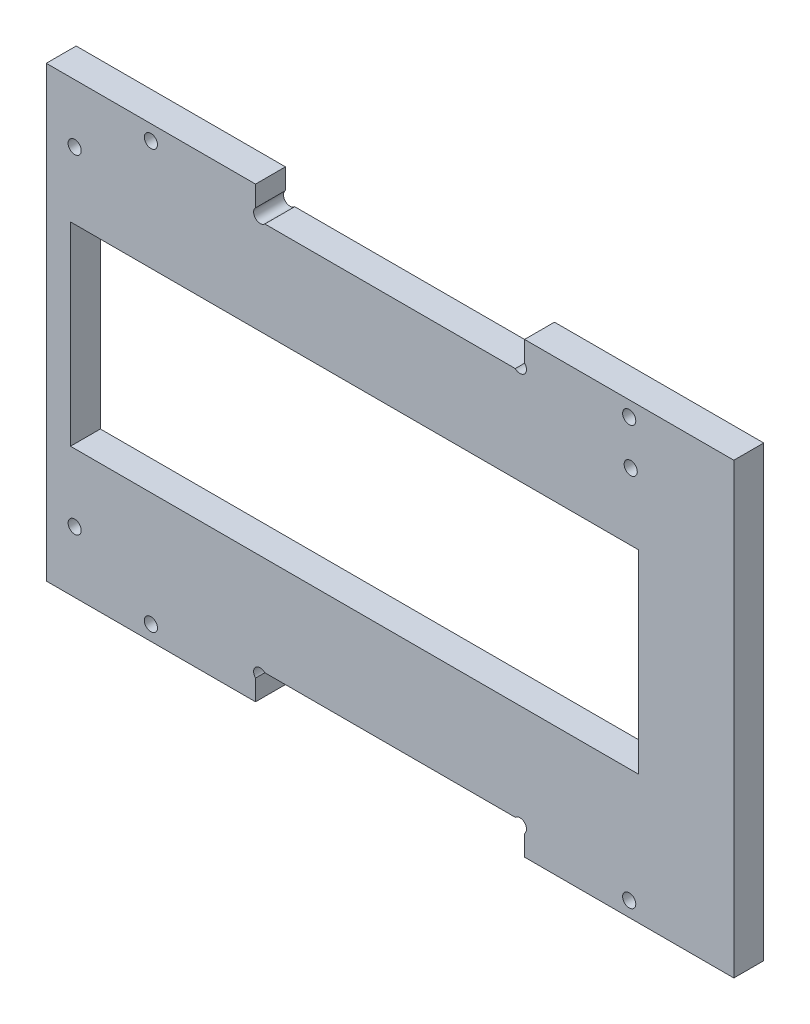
ISO-10303-21;
HEADER;
FILE_DESCRIPTION(('STEP AP214'),'2;1');
FILE_NAME('part.step','',(''),(''),'','','');
FILE_SCHEMA(('AUTOMOTIVE_DESIGN { 1 0 10303 214 1 1 1 1 }'));
ENDSEC;
DATA;
#1=APPLICATION_CONTEXT('core data for automotive mechanical design processes');
#2=APPLICATION_PROTOCOL_DEFINITION('international standard','automotive_design',2000,#1);
#3=PRODUCT_CONTEXT('',#1,'mechanical');
#4=PRODUCT('Part','Part','',(#3));
#5=PRODUCT_RELATED_PRODUCT_CATEGORY('part','',(#4));
#6=PRODUCT_DEFINITION_FORMATION('','',#4);
#7=PRODUCT_DEFINITION_CONTEXT('part definition',#1,'design');
#8=PRODUCT_DEFINITION('design','',#6,#7);
#9=PRODUCT_DEFINITION_SHAPE('','',#8);
#10=(LENGTH_UNIT() NAMED_UNIT(*) SI_UNIT(.MILLI.,.METRE.));
#11=(NAMED_UNIT(*) PLANE_ANGLE_UNIT() SI_UNIT($,.RADIAN.));
#12=(NAMED_UNIT(*) SI_UNIT($,.STERADIAN.) SOLID_ANGLE_UNIT());
#13=UNCERTAINTY_MEASURE_WITH_UNIT(LENGTH_MEASURE(1.E-05),#10,'distance_accuracy_value','');
#14=(GEOMETRIC_REPRESENTATION_CONTEXT(3) GLOBAL_UNCERTAINTY_ASSIGNED_CONTEXT((#13)) GLOBAL_UNIT_ASSIGNED_CONTEXT((#10,
#11,#12)) REPRESENTATION_CONTEXT('',''));
#15=CARTESIAN_POINT('',(0.,0.,0.));
#16=DIRECTION('',(0.,0.,1.));
#17=DIRECTION('',(1.,0.,0.));
#18=AXIS2_PLACEMENT_3D('',#15,#16,#17);
#19=CARTESIAN_POINT('',(0.,75.,5.));
#20=DIRECTION('',(0.,0.,-1.));
#21=DIRECTION('',(-1.,0.,0.));
#22=AXIS2_PLACEMENT_3D('',#19,#20,#21);
#23=PLANE('',#22);
#24=CARTESIAN_POINT('',(17.5,72.5,5.));
#25=DIRECTION('',(0.,0.,-1.));
#26=DIRECTION('',(-1.,0.,0.));
#27=AXIS2_PLACEMENT_3D('',#24,#25,#26);
#28=CIRCLE('',#27,1.10000000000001);
#29=CARTESIAN_POINT('',(16.4,72.5,5.));
#30=VERTEX_POINT('',#29);
#31=EDGE_CURVE('E784',#30,#30,#28,.T.);
#32=ORIENTED_EDGE('',*,*,#31,.T.);
#33=EDGE_LOOP('',(#32));
#34=FACE_BOUND('',#33,.T.);
#35=CARTESIAN_POINT('',(97.5,72.5,5.));
#36=DIRECTION('',(0.,0.,1.));
#37=DIRECTION('',(1.,0.,0.));
#38=AXIS2_PLACEMENT_3D('',#35,#36,#37);
#39=CIRCLE('',#38,1.10000000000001);
#40=CARTESIAN_POINT('',(98.6,72.5,5.));
#41=VERTEX_POINT('',#40);
#42=EDGE_CURVE('E228',#41,#41,#39,.T.);
#43=ORIENTED_EDGE('',*,*,#42,.F.);
#44=EDGE_LOOP('',(#43));
#45=FACE_BOUND('',#44,.T.);
#46=CARTESIAN_POINT('',(4.75,10.25,5.));
#47=DIRECTION('',(0.,0.,1.));
#48=DIRECTION('',(1.,0.,0.));
#49=AXIS2_PLACEMENT_3D('',#46,#47,#48);
#50=CIRCLE('',#49,1.1);
#51=CARTESIAN_POINT('',(5.85,10.25,5.));
#52=VERTEX_POINT('',#51);
#53=EDGE_CURVE('E315',#52,#52,#50,.T.);
#54=ORIENTED_EDGE('',*,*,#53,.F.);
#55=EDGE_LOOP('',(#54));
#56=FACE_BOUND('',#55,.T.);
#57=CARTESIAN_POINT('',(97.75,65.25,5.));
#58=DIRECTION('',(0.,0.,1.));
#59=DIRECTION('',(1.,0.,0.));
#60=AXIS2_PLACEMENT_3D('',#57,#58,#59);
#61=CIRCLE('',#60,1.10000000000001);
#62=CARTESIAN_POINT('',(98.85,65.25,5.));
#63=VERTEX_POINT('',#62);
#64=EDGE_CURVE('E321',#63,#63,#61,.T.);
#65=ORIENTED_EDGE('',*,*,#64,.F.);
#66=EDGE_LOOP('',(#65));
#67=FACE_BOUND('',#66,.T.);
#68=CARTESIAN_POINT('',(4.75,65.25,5.));
#69=DIRECTION('',(0.,0.,1.));
#70=DIRECTION('',(1.,0.,0.));
#71=AXIS2_PLACEMENT_3D('',#68,#69,#70);
#72=CIRCLE('',#71,1.1);
#73=CARTESIAN_POINT('',(5.85,65.25,5.));
#74=VERTEX_POINT('',#73);
#75=EDGE_CURVE('E327',#74,#74,#72,.T.);
#76=ORIENTED_EDGE('',*,*,#75,.F.);
#77=EDGE_LOOP('',(#76));
#78=FACE_BOUND('',#77,.T.);
#79=DIRECTION('',(1.,0.,0.));
#80=VECTOR('',#79,1.);
#81=CARTESIAN_POINT('',(4.05,21.55,5.));
#82=LINE('',#81,#80);
#83=CARTESIAN_POINT('',(4.05,21.55,5.));
#84=VERTEX_POINT('',#83);
#85=CARTESIAN_POINT('',(99.05,21.55,5.));
#86=VERTEX_POINT('',#85);
#87=EDGE_CURVE('E343',#84,#86,#82,.T.);
#88=ORIENTED_EDGE('',*,*,#87,.F.);
#89=DIRECTION('',(0.,-1.,0.));
#90=VECTOR('',#89,1.);
#91=CARTESIAN_POINT('',(4.05,21.55,5.));
#92=LINE('',#91,#90);
#93=CARTESIAN_POINT('',(4.05,54.05,5.));
#94=VERTEX_POINT('',#93);
#95=EDGE_CURVE('E341',#94,#84,#92,.T.);
#96=ORIENTED_EDGE('',*,*,#95,.F.);
#97=DIRECTION('',(-1.,0.,0.));
#98=VECTOR('',#97,1.);
#99=CARTESIAN_POINT('',(4.05,54.05,5.));
#100=LINE('',#99,#98);
#101=CARTESIAN_POINT('',(99.05,54.05,5.));
#102=VERTEX_POINT('',#101);
#103=EDGE_CURVE('E349',#102,#94,#100,.T.);
#104=ORIENTED_EDGE('',*,*,#103,.F.);
#105=DIRECTION('',(0.,1.,0.));
#106=VECTOR('',#105,1.);
#107=CARTESIAN_POINT('',(99.05,21.55,5.));
#108=LINE('',#107,#106);
#109=EDGE_CURVE('E346',#86,#102,#108,.T.);
#110=ORIENTED_EDGE('',*,*,#109,.F.);
#111=EDGE_LOOP('',(#88,#96,#104,#110));
#112=FACE_BOUND('',#111,.T.);
#113=CARTESIAN_POINT('',(79.2221825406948,4.2221825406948,5.));
#114=DIRECTION('',(0.,0.,1.));
#115=DIRECTION('',(1.,0.,0.));
#116=AXIS2_PLACEMENT_3D('',#113,#114,#115);
#117=CIRCLE('',#116,1.10000000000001);
#118=CARTESIAN_POINT('',(80.,3.44436508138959,5.));
#119=VERTEX_POINT('',#118);
#120=CARTESIAN_POINT('',(78.4443650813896,5.,5.));
#121=VERTEX_POINT('',#120);
#122=EDGE_CURVE('E251',#119,#121,#117,.T.);
#123=ORIENTED_EDGE('',*,*,#122,.F.);
#124=DIRECTION('',(0.,1.,0.));
#125=VECTOR('',#124,1.);
#126=CARTESIAN_POINT('',(80.,0.,5.));
#127=LINE('',#126,#125);
#128=CARTESIAN_POINT('',(80.,0.,5.));
#129=VERTEX_POINT('',#128);
#130=EDGE_CURVE('E280',#129,#119,#127,.T.);
#131=ORIENTED_EDGE('',*,*,#130,.F.);
#132=DIRECTION('',(1.,0.,0.));
#133=VECTOR('',#132,1.);
#134=CARTESIAN_POINT('',(0.,0.,5.));
#135=LINE('',#134,#133);
#136=CARTESIAN_POINT('',(115.,0.,5.));
#137=VERTEX_POINT('',#136);
#138=EDGE_CURVE('E368',#129,#137,#135,.T.);
#139=ORIENTED_EDGE('',*,*,#138,.T.);
#140=DIRECTION('',(0.,1.,0.));
#141=VECTOR('',#140,1.);
#142=CARTESIAN_POINT('',(115.,0.,5.));
#143=LINE('',#142,#141);
#144=CARTESIAN_POINT('',(115.,75.,5.));
#145=VERTEX_POINT('',#144);
#146=EDGE_CURVE('E373',#137,#145,#143,.T.);
#147=ORIENTED_EDGE('',*,*,#146,.T.);
#148=DIRECTION('',(-1.,0.,0.));
#149=VECTOR('',#148,1.);
#150=CARTESIAN_POINT('',(0.,75.,5.));
#151=LINE('',#150,#149);
#152=CARTESIAN_POINT('',(80.,75.,5.));
#153=VERTEX_POINT('',#152);
#154=EDGE_CURVE('E376',#145,#153,#151,.T.);
#155=ORIENTED_EDGE('',*,*,#154,.T.);
#156=DIRECTION('',(0.,1.,0.));
#157=VECTOR('',#156,1.);
#158=CARTESIAN_POINT('',(80.,75.,5.));
#159=LINE('',#158,#157);
#160=CARTESIAN_POINT('',(80.,71.5556349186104,5.));
#161=VERTEX_POINT('',#160);
#162=EDGE_CURVE('E304',#161,#153,#159,.T.);
#163=ORIENTED_EDGE('',*,*,#162,.F.);
#164=CARTESIAN_POINT('',(79.2221825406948,70.7778174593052,5.));
#165=DIRECTION('',(0.,0.,1.));
#166=DIRECTION('',(1.,0.,0.));
#167=AXIS2_PLACEMENT_3D('',#164,#165,#166);
#168=CIRCLE('',#167,1.10000000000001);
#169=CARTESIAN_POINT('',(78.4443650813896,70.,5.));
#170=VERTEX_POINT('',#169);
#171=EDGE_CURVE('E264',#170,#161,#168,.T.);
#172=ORIENTED_EDGE('',*,*,#171,.F.);
#173=DIRECTION('',(1.,0.,0.));
#174=VECTOR('',#173,1.);
#175=CARTESIAN_POINT('',(35.,70.,5.));
#176=LINE('',#175,#174);
#177=CARTESIAN_POINT('',(36.5556349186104,70.,5.));
#178=VERTEX_POINT('',#177);
#179=EDGE_CURVE('E301',#178,#170,#176,.T.);
#180=ORIENTED_EDGE('',*,*,#179,.F.);
#181=CARTESIAN_POINT('',(35.7778174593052,70.7778174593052,5.));
#182=DIRECTION('',(0.,0.,1.));
#183=DIRECTION('',(1.,0.,0.));
#184=AXIS2_PLACEMENT_3D('',#181,#182,#183);
#185=CIRCLE('',#184,1.1);
#186=CARTESIAN_POINT('',(35.,71.5556349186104,5.));
#187=VERTEX_POINT('',#186);
#188=EDGE_CURVE('E270',#187,#178,#185,.T.);
#189=ORIENTED_EDGE('',*,*,#188,.F.);
#190=DIRECTION('',(0.,-1.,0.));
#191=VECTOR('',#190,1.);
#192=CARTESIAN_POINT('',(35.,75.,5.));
#193=LINE('',#192,#191);
#194=CARTESIAN_POINT('',(35.,75.,5.));
#195=VERTEX_POINT('',#194);
#196=EDGE_CURVE('E298',#195,#187,#193,.T.);
#197=ORIENTED_EDGE('',*,*,#196,.F.);
#198=CARTESIAN_POINT('',(0.,75.,5.));
#199=VERTEX_POINT('',#198);
#200=EDGE_CURVE('E375',#195,#199,#151,.T.);
#201=ORIENTED_EDGE('',*,*,#200,.T.);
#202=DIRECTION('',(0.,-1.,0.));
#203=VECTOR('',#202,1.);
#204=CARTESIAN_POINT('',(0.,0.,5.));
#205=LINE('',#204,#203);
#206=CARTESIAN_POINT('',(0.,0.,5.));
#207=VERTEX_POINT('',#206);
#208=EDGE_CURVE('E365',#199,#207,#205,.T.);
#209=ORIENTED_EDGE('',*,*,#208,.T.);
#210=CARTESIAN_POINT('',(35.,0.,5.));
#211=VERTEX_POINT('',#210);
#212=EDGE_CURVE('E370',#207,#211,#135,.T.);
#213=ORIENTED_EDGE('',*,*,#212,.T.);
#214=DIRECTION('',(0.,-1.,0.));
#215=VECTOR('',#214,1.);
#216=CARTESIAN_POINT('',(35.,0.,5.));
#217=LINE('',#216,#215);
#218=CARTESIAN_POINT('',(35.,3.44436508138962,5.));
#219=VERTEX_POINT('',#218);
#220=EDGE_CURVE('E285',#219,#211,#217,.T.);
#221=ORIENTED_EDGE('',*,*,#220,.F.);
#222=CARTESIAN_POINT('',(35.7778174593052,4.2221825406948,5.));
#223=DIRECTION('',(0.,0.,1.));
#224=DIRECTION('',(1.,0.,0.));
#225=AXIS2_PLACEMENT_3D('',#222,#223,#224);
#226=CIRCLE('',#225,1.09999999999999);
#227=CARTESIAN_POINT('',(36.5556349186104,4.99999999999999,5.));
#228=VERTEX_POINT('',#227);
#229=EDGE_CURVE('E258',#228,#219,#226,.T.);
#230=ORIENTED_EDGE('',*,*,#229,.F.);
#231=DIRECTION('',(-1.,0.,0.));
#232=VECTOR('',#231,1.);
#233=CARTESIAN_POINT('',(80.,5.,5.));
#234=LINE('',#233,#232);
#235=EDGE_CURVE('E283',#121,#228,#234,.T.);
#236=ORIENTED_EDGE('',*,*,#235,.F.);
#237=EDGE_LOOP('',(#123,#131,#139,#147,#155,#163,#172,#180,#189,#197,#201,#209,#213,#221,#230,#236));
#238=FACE_BOUND('',#237,.T.);
#239=CARTESIAN_POINT('',(17.5,2.5,5.));
#240=DIRECTION('',(0.,0.,1.));
#241=DIRECTION('',(-1.,0.,0.));
#242=AXIS2_PLACEMENT_3D('',#239,#240,#241);
#243=CIRCLE('',#242,1.10000000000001);
#244=CARTESIAN_POINT('',(16.4,2.5,5.));
#245=VERTEX_POINT('',#244);
#246=EDGE_CURVE('E781',#245,#245,#243,.T.);
#247=ORIENTED_EDGE('',*,*,#246,.F.);
#248=EDGE_LOOP('',(#247));
#249=FACE_BOUND('',#248,.T.);
#250=CARTESIAN_POINT('',(97.5,2.5,5.));
#251=DIRECTION('',(0.,0.,-1.));
#252=DIRECTION('',(1.,0.,0.));
#253=AXIS2_PLACEMENT_3D('',#250,#251,#252);
#254=CIRCLE('',#253,1.10000000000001);
#255=CARTESIAN_POINT('',(98.6,2.5,5.));
#256=VERTEX_POINT('',#255);
#257=EDGE_CURVE('E775',#256,#256,#254,.T.);
#258=ORIENTED_EDGE('',*,*,#257,.T.);
#259=EDGE_LOOP('',(#258));
#260=FACE_BOUND('',#259,.T.);
#261=ADVANCED_FACE('F33',(#34,#45,#56,#67,#78,#112,#238,#249,#260),#23,.F.);
#262=CARTESIAN_POINT('',(0.,75.,0.));
#263=DIRECTION('',(0.,0.,-1.));
#264=DIRECTION('',(-1.,0.,0.));
#265=AXIS2_PLACEMENT_3D('',#262,#263,#264);
#266=PLANE('',#265);
#267=CARTESIAN_POINT('',(17.5,72.5,0.));
#268=DIRECTION('',(0.,0.,-1.));
#269=DIRECTION('',(-1.,0.,0.));
#270=AXIS2_PLACEMENT_3D('',#267,#268,#269);
#271=CIRCLE('',#270,1.10000000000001);
#272=CARTESIAN_POINT('',(16.4,72.5,0.));
#273=VERTEX_POINT('',#272);
#274=EDGE_CURVE('E788',#273,#273,#271,.T.);
#275=ORIENTED_EDGE('',*,*,#274,.F.);
#276=EDGE_LOOP('',(#275));
#277=FACE_BOUND('',#276,.T.);
#278=CARTESIAN_POINT('',(97.5,72.5,0.));
#279=DIRECTION('',(0.,0.,-1.));
#280=DIRECTION('',(-1.,0.,0.));
#281=AXIS2_PLACEMENT_3D('',#278,#279,#280);
#282=CIRCLE('',#281,1.10000000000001);
#283=CARTESIAN_POINT('',(96.4,72.5,0.));
#284=VERTEX_POINT('',#283);
#285=EDGE_CURVE('E221',#284,#284,#282,.F.);
#286=ORIENTED_EDGE('',*,*,#285,.T.);
#287=EDGE_LOOP('',(#286));
#288=FACE_BOUND('',#287,.T.);
#289=DIRECTION('',(0.,-1.,0.));
#290=VECTOR('',#289,1.);
#291=CARTESIAN_POINT('',(92.75,13.5,0.));
#292=LINE('',#291,#290);
#293=CARTESIAN_POINT('',(92.75,13.5,0.));
#294=VERTEX_POINT('',#293);
#295=CARTESIAN_POINT('',(92.75,7.49999999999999,0.));
#296=VERTEX_POINT('',#295);
#297=EDGE_CURVE('E48',#294,#296,#292,.T.);
#298=ORIENTED_EDGE('',*,*,#297,.F.);
#299=DIRECTION('',(1.,0.,0.));
#300=VECTOR('',#299,1.);
#301=CARTESIAN_POINT('',(92.75,13.5,0.));
#302=LINE('',#301,#300);
#303=CARTESIAN_POINT('',(52.75,13.5,0.));
#304=VERTEX_POINT('',#303);
#305=EDGE_CURVE('E215',#304,#294,#302,.T.);
#306=ORIENTED_EDGE('',*,*,#305,.F.);
#307=DIRECTION('',(0.,1.,0.));
#308=VECTOR('',#307,1.);
#309=CARTESIAN_POINT('',(52.75,13.5,0.));
#310=LINE('',#309,#308);
#311=CARTESIAN_POINT('',(52.75,7.5,0.));
#312=VERTEX_POINT('',#311);
#313=EDGE_CURVE('E218',#312,#304,#310,.T.);
#314=ORIENTED_EDGE('',*,*,#313,.F.);
#315=DIRECTION('',(-1.,0.,0.));
#316=VECTOR('',#315,1.);
#317=CARTESIAN_POINT('',(92.75,7.5,0.));
#318=LINE('',#317,#316);
#319=EDGE_CURVE('E227',#296,#312,#318,.T.);
#320=ORIENTED_EDGE('',*,*,#319,.F.);
#321=EDGE_LOOP('',(#298,#306,#314,#320));
#322=FACE_BOUND('',#321,.T.);
#323=DIRECTION('',(0.,1.,0.));
#324=VECTOR('',#323,1.);
#325=CARTESIAN_POINT('',(80.,0.,0.));
#326=LINE('',#325,#324);
#327=CARTESIAN_POINT('',(80.,0.,0.));
#328=VERTEX_POINT('',#327);
#329=CARTESIAN_POINT('',(80.,3.44436508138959,0.));
#330=VERTEX_POINT('',#329);
#331=EDGE_CURVE('E277',#328,#330,#326,.T.);
#332=ORIENTED_EDGE('',*,*,#331,.T.);
#333=CARTESIAN_POINT('',(79.2221825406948,4.2221825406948,0.));
#334=DIRECTION('',(0.,0.,-1.));
#335=DIRECTION('',(-1.,0.,0.));
#336=AXIS2_PLACEMENT_3D('',#333,#334,#335);
#337=CIRCLE('',#336,1.10000000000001);
#338=CARTESIAN_POINT('',(78.4443650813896,5.,0.));
#339=VERTEX_POINT('',#338);
#340=EDGE_CURVE('E253',#330,#339,#337,.F.);
#341=ORIENTED_EDGE('',*,*,#340,.T.);
#342=DIRECTION('',(-1.,0.,0.));
#343=VECTOR('',#342,1.);
#344=CARTESIAN_POINT('',(80.,5.,0.));
#345=LINE('',#344,#343);
#346=CARTESIAN_POINT('',(36.5556349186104,4.99999999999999,0.));
#347=VERTEX_POINT('',#346);
#348=EDGE_CURVE('E56',#339,#347,#345,.T.);
#349=ORIENTED_EDGE('',*,*,#348,.T.);
#350=CARTESIAN_POINT('',(35.7778174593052,4.2221825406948,0.));
#351=DIRECTION('',(0.,0.,-1.));
#352=DIRECTION('',(-1.,0.,0.));
#353=AXIS2_PLACEMENT_3D('',#350,#351,#352);
#354=CIRCLE('',#353,1.09999999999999);
#355=CARTESIAN_POINT('',(35.,3.44436508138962,0.));
#356=VERTEX_POINT('',#355);
#357=EDGE_CURVE('E260',#347,#356,#354,.F.);
#358=ORIENTED_EDGE('',*,*,#357,.T.);
#359=DIRECTION('',(0.,-1.,0.));
#360=VECTOR('',#359,1.);
#361=CARTESIAN_POINT('',(35.,0.,0.));
#362=LINE('',#361,#360);
#363=CARTESIAN_POINT('',(35.,0.,0.));
#364=VERTEX_POINT('',#363);
#365=EDGE_CURVE('E275',#356,#364,#362,.T.);
#366=ORIENTED_EDGE('',*,*,#365,.T.);
#367=DIRECTION('',(1.,0.,0.));
#368=VECTOR('',#367,1.);
#369=CARTESIAN_POINT('',(0.,0.,0.));
#370=LINE('',#369,#368);
#371=CARTESIAN_POINT('',(0.,0.,0.));
#372=VERTEX_POINT('',#371);
#373=EDGE_CURVE('E383',#372,#364,#370,.T.);
#374=ORIENTED_EDGE('',*,*,#373,.F.);
#375=DIRECTION('',(0.,-1.,0.));
#376=VECTOR('',#375,1.);
#377=CARTESIAN_POINT('',(0.,0.,0.));
#378=LINE('',#377,#376);
#379=CARTESIAN_POINT('',(0.,75.,0.));
#380=VERTEX_POINT('',#379);
#381=EDGE_CURVE('E364',#380,#372,#378,.T.);
#382=ORIENTED_EDGE('',*,*,#381,.F.);
#383=DIRECTION('',(-1.,0.,0.));
#384=VECTOR('',#383,1.);
#385=CARTESIAN_POINT('',(0.,75.,0.));
#386=LINE('',#385,#384);
#387=CARTESIAN_POINT('',(35.,75.,0.));
#388=VERTEX_POINT('',#387);
#389=EDGE_CURVE('E388',#388,#380,#386,.T.);
#390=ORIENTED_EDGE('',*,*,#389,.F.);
#391=DIRECTION('',(0.,-1.,0.));
#392=VECTOR('',#391,1.);
#393=CARTESIAN_POINT('',(35.,75.,0.));
#394=LINE('',#393,#392);
#395=CARTESIAN_POINT('',(35.,71.5556349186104,0.));
#396=VERTEX_POINT('',#395);
#397=EDGE_CURVE('E295',#388,#396,#394,.T.);
#398=ORIENTED_EDGE('',*,*,#397,.T.);
#399=CARTESIAN_POINT('',(35.7778174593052,70.7778174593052,0.));
#400=DIRECTION('',(0.,0.,-1.));
#401=DIRECTION('',(-1.,0.,0.));
#402=AXIS2_PLACEMENT_3D('',#399,#400,#401);
#403=CIRCLE('',#402,1.1);
#404=CARTESIAN_POINT('',(36.5556349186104,70.,0.));
#405=VERTEX_POINT('',#404);
#406=EDGE_CURVE('E272',#396,#405,#403,.F.);
#407=ORIENTED_EDGE('',*,*,#406,.T.);
#408=DIRECTION('',(1.,0.,0.));
#409=VECTOR('',#408,1.);
#410=CARTESIAN_POINT('',(35.,70.,0.));
#411=LINE('',#410,#409);
#412=CARTESIAN_POINT('',(78.4443650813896,70.,0.));
#413=VERTEX_POINT('',#412);
#414=EDGE_CURVE('E309',#405,#413,#411,.T.);
#415=ORIENTED_EDGE('',*,*,#414,.T.);
#416=CARTESIAN_POINT('',(79.2221825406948,70.7778174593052,0.));
#417=DIRECTION('',(0.,0.,-1.));
#418=DIRECTION('',(-1.,0.,0.));
#419=AXIS2_PLACEMENT_3D('',#416,#417,#418);
#420=CIRCLE('',#419,1.10000000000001);
#421=CARTESIAN_POINT('',(80.,71.5556349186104,0.));
#422=VERTEX_POINT('',#421);
#423=EDGE_CURVE('E266',#413,#422,#420,.F.);
#424=ORIENTED_EDGE('',*,*,#423,.T.);
#425=DIRECTION('',(0.,1.,0.));
#426=VECTOR('',#425,1.);
#427=CARTESIAN_POINT('',(80.,75.,0.));
#428=LINE('',#427,#426);
#429=CARTESIAN_POINT('',(80.,75.,0.));
#430=VERTEX_POINT('',#429);
#431=EDGE_CURVE('E293',#422,#430,#428,.T.);
#432=ORIENTED_EDGE('',*,*,#431,.T.);
#433=CARTESIAN_POINT('',(115.,75.,0.));
#434=VERTEX_POINT('',#433);
#435=EDGE_CURVE('E369',#434,#430,#386,.T.);
#436=ORIENTED_EDGE('',*,*,#435,.F.);
#437=DIRECTION('',(0.,1.,0.));
#438=VECTOR('',#437,1.);
#439=CARTESIAN_POINT('',(115.,0.,0.));
#440=LINE('',#439,#438);
#441=CARTESIAN_POINT('',(115.,0.,0.));
#442=VERTEX_POINT('',#441);
#443=EDGE_CURVE('E386',#442,#434,#440,.T.);
#444=ORIENTED_EDGE('',*,*,#443,.F.);
#445=EDGE_CURVE('E382',#328,#442,#370,.T.);
#446=ORIENTED_EDGE('',*,*,#445,.F.);
#447=EDGE_LOOP('',(#332,#341,#349,#358,#366,#374,#382,#390,#398,#407,#415,#424,#432,#436,#444,#446));
#448=FACE_BOUND('',#447,.T.);
#449=CARTESIAN_POINT('',(4.75,10.25,0.));
#450=DIRECTION('',(0.,0.,-1.));
#451=DIRECTION('',(-1.,0.,0.));
#452=AXIS2_PLACEMENT_3D('',#449,#450,#451);
#453=CIRCLE('',#452,1.1);
#454=CARTESIAN_POINT('',(3.65,10.25,0.));
#455=VERTEX_POINT('',#454);
#456=EDGE_CURVE('E314',#455,#455,#453,.F.);
#457=ORIENTED_EDGE('',*,*,#456,.T.);
#458=EDGE_LOOP('',(#457));
#459=FACE_BOUND('',#458,.T.);
#460=CARTESIAN_POINT('',(97.75,65.25,0.));
#461=DIRECTION('',(0.,0.,-1.));
#462=DIRECTION('',(-1.,0.,0.));
#463=AXIS2_PLACEMENT_3D('',#460,#461,#462);
#464=CIRCLE('',#463,1.10000000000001);
#465=CARTESIAN_POINT('',(96.65,65.25,0.));
#466=VERTEX_POINT('',#465);
#467=EDGE_CURVE('E318',#466,#466,#464,.F.);
#468=ORIENTED_EDGE('',*,*,#467,.T.);
#469=EDGE_LOOP('',(#468));
#470=FACE_BOUND('',#469,.T.);
#471=CARTESIAN_POINT('',(4.75,65.25,0.));
#472=DIRECTION('',(0.,0.,-1.));
#473=DIRECTION('',(-1.,0.,0.));
#474=AXIS2_PLACEMENT_3D('',#471,#472,#473);
#475=CIRCLE('',#474,1.1);
#476=CARTESIAN_POINT('',(3.65,65.25,0.));
#477=VERTEX_POINT('',#476);
#478=EDGE_CURVE('E324',#477,#477,#475,.F.);
#479=ORIENTED_EDGE('',*,*,#478,.T.);
#480=EDGE_LOOP('',(#479));
#481=FACE_BOUND('',#480,.T.);
#482=DIRECTION('',(0.,-1.,0.));
#483=VECTOR('',#482,1.);
#484=CARTESIAN_POINT('',(4.05,21.55,0.));
#485=LINE('',#484,#483);
#486=CARTESIAN_POINT('',(4.05,54.05,0.));
#487=VERTEX_POINT('',#486);
#488=CARTESIAN_POINT('',(4.05,21.55,0.));
#489=VERTEX_POINT('',#488);
#490=EDGE_CURVE('E338',#487,#489,#485,.T.);
#491=ORIENTED_EDGE('',*,*,#490,.T.);
#492=DIRECTION('',(1.,0.,0.));
#493=VECTOR('',#492,1.);
#494=CARTESIAN_POINT('',(4.05,21.55,0.));
#495=LINE('',#494,#493);
#496=CARTESIAN_POINT('',(99.05,21.55,0.));
#497=VERTEX_POINT('',#496);
#498=EDGE_CURVE('E355',#489,#497,#495,.T.);
#499=ORIENTED_EDGE('',*,*,#498,.T.);
#500=DIRECTION('',(0.,1.,0.));
#501=VECTOR('',#500,1.);
#502=CARTESIAN_POINT('',(99.05,21.55,0.));
#503=LINE('',#502,#501);
#504=CARTESIAN_POINT('',(99.05,54.05,0.));
#505=VERTEX_POINT('',#504);
#506=EDGE_CURVE('E330',#497,#505,#503,.T.);
#507=ORIENTED_EDGE('',*,*,#506,.T.);
#508=DIRECTION('',(-1.,0.,0.));
#509=VECTOR('',#508,1.);
#510=CARTESIAN_POINT('',(4.05,54.05,0.));
#511=LINE('',#510,#509);
#512=EDGE_CURVE('E335',#505,#487,#511,.T.);
#513=ORIENTED_EDGE('',*,*,#512,.T.);
#514=EDGE_LOOP('',(#491,#499,#507,#513));
#515=FACE_BOUND('',#514,.T.);
#516=CARTESIAN_POINT('',(17.5,2.5,0.));
#517=DIRECTION('',(0.,0.,-1.));
#518=DIRECTION('',(-1.,0.,0.));
#519=AXIS2_PLACEMENT_3D('',#516,#517,#518);
#520=CIRCLE('',#519,1.10000000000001);
#521=CARTESIAN_POINT('',(16.4,2.5,0.));
#522=VERTEX_POINT('',#521);
#523=EDGE_CURVE('E778',#522,#522,#520,.F.);
#524=ORIENTED_EDGE('',*,*,#523,.T.);
#525=EDGE_LOOP('',(#524));
#526=FACE_BOUND('',#525,.T.);
#527=CARTESIAN_POINT('',(97.5,2.5,0.));
#528=DIRECTION('',(0.,0.,-1.));
#529=DIRECTION('',(-1.,0.,0.));
#530=AXIS2_PLACEMENT_3D('',#527,#528,#529);
#531=CIRCLE('',#530,1.10000000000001);
#532=CARTESIAN_POINT('',(96.4,2.5,0.));
#533=VERTEX_POINT('',#532);
#534=EDGE_CURVE('E772',#533,#533,#531,.T.);
#535=ORIENTED_EDGE('',*,*,#534,.F.);
#536=EDGE_LOOP('',(#535));
#537=FACE_BOUND('',#536,.T.);
#538=ADVANCED_FACE('F406',(#277,#288,#322,#448,#459,#470,#481,#515,#526,#537),#266,.T.);
#539=CARTESIAN_POINT('',(0.,0.,5.));
#540=DIRECTION('',(0.,1.,0.));
#541=DIRECTION('',(0.,0.,1.));
#542=AXIS2_PLACEMENT_3D('',#539,#540,#541);
#543=PLANE('',#542);
#544=ORIENTED_EDGE('',*,*,#138,.F.);
#545=DIRECTION('',(0.,0.,1.));
#546=VECTOR('',#545,1.);
#547=CARTESIAN_POINT('',(80.,0.,-0.00100000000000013));
#548=LINE('',#547,#546);
#549=EDGE_CURVE('E288',#328,#129,#548,.T.);
#550=ORIENTED_EDGE('',*,*,#549,.F.);
#551=ORIENTED_EDGE('',*,*,#445,.T.);
#552=DIRECTION('',(0.,0.,-1.));
#553=VECTOR('',#552,1.);
#554=CARTESIAN_POINT('',(115.,0.,5.));
#555=LINE('',#554,#553);
#556=EDGE_CURVE('E41',#137,#442,#555,.T.);
#557=ORIENTED_EDGE('',*,*,#556,.F.);
#558=EDGE_LOOP('',(#544,#550,#551,#557));
#559=FACE_BOUND('',#558,.T.);
#560=ADVANCED_FACE('F419',(#559),#543,.F.);
#561=CARTESIAN_POINT('',(0.,75.,5.));
#562=DIRECTION('',(0.,-1.,0.));
#563=DIRECTION('',(0.,0.,-1.));
#564=AXIS2_PLACEMENT_3D('',#561,#562,#563);
#565=PLANE('',#564);
#566=ORIENTED_EDGE('',*,*,#200,.F.);
#567=DIRECTION('',(0.,0.,1.));
#568=VECTOR('',#567,1.);
#569=CARTESIAN_POINT('',(35.,75.,-0.00100000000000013));
#570=LINE('',#569,#568);
#571=EDGE_CURVE('E307',#388,#195,#570,.T.);
#572=ORIENTED_EDGE('',*,*,#571,.F.);
#573=ORIENTED_EDGE('',*,*,#389,.T.);
#574=DIRECTION('',(0.,0.,-1.));
#575=VECTOR('',#574,1.);
#576=CARTESIAN_POINT('',(0.,75.,5.));
#577=LINE('',#576,#575);
#578=EDGE_CURVE('E379',#199,#380,#577,.T.);
#579=ORIENTED_EDGE('',*,*,#578,.F.);
#580=EDGE_LOOP('',(#566,#572,#573,#579));
#581=FACE_BOUND('',#580,.T.);
#582=ADVANCED_FACE('F448',(#581),#565,.F.);
#583=CARTESIAN_POINT('',(0.,0.,5.));
#584=DIRECTION('',(1.,0.,0.));
#585=DIRECTION('',(0.,0.,-1.));
#586=AXIS2_PLACEMENT_3D('',#583,#584,#585);
#587=PLANE('',#586);
#588=ORIENTED_EDGE('',*,*,#381,.T.);
#589=DIRECTION('',(0.,0.,-1.));
#590=VECTOR('',#589,1.);
#591=CARTESIAN_POINT('',(0.,0.,5.));
#592=LINE('',#591,#590);
#593=EDGE_CURVE('E11',#207,#372,#592,.T.);
#594=ORIENTED_EDGE('',*,*,#593,.F.);
#595=ORIENTED_EDGE('',*,*,#208,.F.);
#596=ORIENTED_EDGE('',*,*,#578,.T.);
#597=EDGE_LOOP('',(#588,#594,#595,#596));
#598=FACE_BOUND('',#597,.T.);
#599=ADVANCED_FACE('F35',(#598),#587,.F.);
#600=ORIENTED_EDGE('',*,*,#373,.T.);
#601=DIRECTION('',(0.,0.,1.));
#602=VECTOR('',#601,1.);
#603=CARTESIAN_POINT('',(35.,0.,-0.00100000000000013));
#604=LINE('',#603,#602);
#605=EDGE_CURVE('E287',#364,#211,#604,.T.);
#606=ORIENTED_EDGE('',*,*,#605,.T.);
#607=ORIENTED_EDGE('',*,*,#212,.F.);
#608=ORIENTED_EDGE('',*,*,#593,.T.);
#609=EDGE_LOOP('',(#600,#606,#607,#608));
#610=FACE_BOUND('',#609,.T.);
#611=ADVANCED_FACE('F439',(#610),#543,.F.);
#612=CARTESIAN_POINT('',(115.,0.,5.));
#613=DIRECTION('',(-1.,0.,0.));
#614=DIRECTION('',(0.,0.,1.));
#615=AXIS2_PLACEMENT_3D('',#612,#613,#614);
#616=PLANE('',#615);
#617=ORIENTED_EDGE('',*,*,#443,.T.);
#618=DIRECTION('',(0.,0.,-1.));
#619=VECTOR('',#618,1.);
#620=CARTESIAN_POINT('',(115.,75.,5.));
#621=LINE('',#620,#619);
#622=EDGE_CURVE('E393',#145,#434,#621,.T.);
#623=ORIENTED_EDGE('',*,*,#622,.F.);
#624=ORIENTED_EDGE('',*,*,#146,.F.);
#625=ORIENTED_EDGE('',*,*,#556,.T.);
#626=EDGE_LOOP('',(#617,#623,#624,#625));
#627=FACE_BOUND('',#626,.T.);
#628=ADVANCED_FACE('F400',(#627),#616,.F.);
#629=ORIENTED_EDGE('',*,*,#435,.T.);
#630=DIRECTION('',(0.,0.,1.));
#631=VECTOR('',#630,1.);
#632=CARTESIAN_POINT('',(80.,75.,-0.00100000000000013));
#633=LINE('',#632,#631);
#634=EDGE_CURVE('E306',#430,#153,#633,.T.);
#635=ORIENTED_EDGE('',*,*,#634,.T.);
#636=ORIENTED_EDGE('',*,*,#154,.F.);
#637=ORIENTED_EDGE('',*,*,#622,.T.);
#638=EDGE_LOOP('',(#629,#635,#636,#637));
#639=FACE_BOUND('',#638,.T.);
#640=ADVANCED_FACE('F411',(#639),#565,.F.);
#641=CARTESIAN_POINT('',(4.05,21.55,-0.00100000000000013));
#642=DIRECTION('',(-1.,0.,0.));
#643=DIRECTION('',(0.,0.,1.));
#644=AXIS2_PLACEMENT_3D('',#641,#642,#643);
#645=PLANE('',#644);
#646=DIRECTION('',(0.,0.,1.));
#647=VECTOR('',#646,1.);
#648=CARTESIAN_POINT('',(4.05,54.05,-0.00100000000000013));
#649=LINE('',#648,#647);
#650=EDGE_CURVE('E353',#487,#94,#649,.T.);
#651=ORIENTED_EDGE('',*,*,#650,.T.);
#652=ORIENTED_EDGE('',*,*,#95,.T.);
#653=DIRECTION('',(0.,0.,1.));
#654=VECTOR('',#653,1.);
#655=CARTESIAN_POINT('',(4.05,21.55,-0.00100000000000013));
#656=LINE('',#655,#654);
#657=EDGE_CURVE('E352',#489,#84,#656,.T.);
#658=ORIENTED_EDGE('',*,*,#657,.F.);
#659=ORIENTED_EDGE('',*,*,#490,.F.);
#660=EDGE_LOOP('',(#651,#652,#658,#659));
#661=FACE_BOUND('',#660,.T.);
#662=ADVANCED_FACE('F488',(#661),#645,.F.);
#663=CARTESIAN_POINT('',(4.05,54.05,-0.00100000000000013));
#664=DIRECTION('',(0.,1.,0.));
#665=DIRECTION('',(0.,0.,1.));
#666=AXIS2_PLACEMENT_3D('',#663,#664,#665);
#667=PLANE('',#666);
#668=DIRECTION('',(0.,0.,1.));
#669=VECTOR('',#668,1.);
#670=CARTESIAN_POINT('',(99.05,54.05,-0.00100000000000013));
#671=LINE('',#670,#669);
#672=EDGE_CURVE('E356',#505,#102,#671,.T.);
#673=ORIENTED_EDGE('',*,*,#672,.T.);
#674=ORIENTED_EDGE('',*,*,#103,.T.);
#675=ORIENTED_EDGE('',*,*,#650,.F.);
#676=ORIENTED_EDGE('',*,*,#512,.F.);
#677=EDGE_LOOP('',(#673,#674,#675,#676));
#678=FACE_BOUND('',#677,.T.);
#679=ADVANCED_FACE('F525',(#678),#667,.F.);
#680=CARTESIAN_POINT('',(99.05,21.55,-0.00100000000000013));
#681=DIRECTION('',(1.,0.,0.));
#682=DIRECTION('',(0.,0.,-1.));
#683=AXIS2_PLACEMENT_3D('',#680,#681,#682);
#684=PLANE('',#683);
#685=DIRECTION('',(0.,0.,1.));
#686=VECTOR('',#685,1.);
#687=CARTESIAN_POINT('',(99.05,21.55,-0.00100000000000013));
#688=LINE('',#687,#686);
#689=EDGE_CURVE('E358',#497,#86,#688,.T.);
#690=ORIENTED_EDGE('',*,*,#689,.T.);
#691=ORIENTED_EDGE('',*,*,#109,.T.);
#692=ORIENTED_EDGE('',*,*,#672,.F.);
#693=ORIENTED_EDGE('',*,*,#506,.F.);
#694=EDGE_LOOP('',(#690,#691,#692,#693));
#695=FACE_BOUND('',#694,.T.);
#696=ADVANCED_FACE('F534',(#695),#684,.F.);
#697=CARTESIAN_POINT('',(4.05,21.55,-0.00100000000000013));
#698=DIRECTION('',(0.,-1.,0.));
#699=DIRECTION('',(0.,0.,-1.));
#700=AXIS2_PLACEMENT_3D('',#697,#698,#699);
#701=PLANE('',#700);
#702=ORIENTED_EDGE('',*,*,#657,.T.);
#703=ORIENTED_EDGE('',*,*,#87,.T.);
#704=ORIENTED_EDGE('',*,*,#689,.F.);
#705=ORIENTED_EDGE('',*,*,#498,.F.);
#706=EDGE_LOOP('',(#702,#703,#704,#705));
#707=FACE_BOUND('',#706,.T.);
#708=ADVANCED_FACE('F544',(#707),#701,.F.);
#709=CARTESIAN_POINT('',(4.75,65.25,-0.00100000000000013));
#710=DIRECTION('',(0.,0.,1.));
#711=DIRECTION('',(1.,0.,0.));
#712=AXIS2_PLACEMENT_3D('',#709,#710,#711);
#713=CYLINDRICAL_SURFACE('',#712,1.1);
#714=ORIENTED_EDGE('',*,*,#478,.F.);
#715=EDGE_LOOP('',(#714));
#716=FACE_BOUND('',#715,.T.);
#717=ORIENTED_EDGE('',*,*,#75,.T.);
#718=EDGE_LOOP('',(#717));
#719=FACE_BOUND('',#718,.T.);
#720=ADVANCED_FACE('F554',(#716,#719),#713,.F.);
#721=CARTESIAN_POINT('',(97.75,65.25,-0.00100000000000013));
#722=DIRECTION('',(0.,0.,1.));
#723=DIRECTION('',(1.,0.,0.));
#724=AXIS2_PLACEMENT_3D('',#721,#722,#723);
#725=CYLINDRICAL_SURFACE('',#724,1.10000000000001);
#726=ORIENTED_EDGE('',*,*,#467,.F.);
#727=EDGE_LOOP('',(#726));
#728=FACE_BOUND('',#727,.T.);
#729=ORIENTED_EDGE('',*,*,#64,.T.);
#730=EDGE_LOOP('',(#729));
#731=FACE_BOUND('',#730,.T.);
#732=ADVANCED_FACE('F563',(#728,#731),#725,.F.);
#733=CARTESIAN_POINT('',(4.75,10.25,-0.00100000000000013));
#734=DIRECTION('',(0.,0.,1.));
#735=DIRECTION('',(1.,0.,0.));
#736=AXIS2_PLACEMENT_3D('',#733,#734,#735);
#737=CYLINDRICAL_SURFACE('',#736,1.1);
#738=ORIENTED_EDGE('',*,*,#456,.F.);
#739=EDGE_LOOP('',(#738));
#740=FACE_BOUND('',#739,.T.);
#741=ORIENTED_EDGE('',*,*,#53,.T.);
#742=EDGE_LOOP('',(#741));
#743=FACE_BOUND('',#742,.T.);
#744=ADVANCED_FACE('F474',(#740,#743),#737,.F.);
#745=CARTESIAN_POINT('',(35.,75.,-0.00100000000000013));
#746=DIRECTION('',(-1.,0.,0.));
#747=DIRECTION('',(0.,0.,1.));
#748=AXIS2_PLACEMENT_3D('',#745,#746,#747);
#749=PLANE('',#748);
#750=ORIENTED_EDGE('',*,*,#196,.T.);
#751=DIRECTION('',(0.,0.,1.));
#752=VECTOR('',#751,1.);
#753=CARTESIAN_POINT('',(35.,71.5556349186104,-0.00100000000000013));
#754=LINE('',#753,#752);
#755=EDGE_CURVE('E246',#396,#187,#754,.T.);
#756=ORIENTED_EDGE('',*,*,#755,.F.);
#757=ORIENTED_EDGE('',*,*,#397,.F.);
#758=ORIENTED_EDGE('',*,*,#571,.T.);
#759=EDGE_LOOP('',(#750,#756,#757,#758));
#760=FACE_BOUND('',#759,.T.);
#761=ADVANCED_FACE('F452',(#760),#749,.F.);
#762=CARTESIAN_POINT('',(80.,75.,-0.00100000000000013));
#763=DIRECTION('',(1.,0.,0.));
#764=DIRECTION('',(0.,0.,-1.));
#765=AXIS2_PLACEMENT_3D('',#762,#763,#764);
#766=PLANE('',#765);
#767=ORIENTED_EDGE('',*,*,#431,.F.);
#768=DIRECTION('',(0.,0.,1.));
#769=VECTOR('',#768,1.);
#770=CARTESIAN_POINT('',(80.,71.5556349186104,-0.00100000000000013));
#771=LINE('',#770,#769);
#772=EDGE_CURVE('E243',#161,#422,#771,.F.);
#773=ORIENTED_EDGE('',*,*,#772,.F.);
#774=ORIENTED_EDGE('',*,*,#162,.T.);
#775=ORIENTED_EDGE('',*,*,#634,.F.);
#776=EDGE_LOOP('',(#767,#773,#774,#775));
#777=FACE_BOUND('',#776,.T.);
#778=ADVANCED_FACE('F466',(#777),#766,.F.);
#779=CARTESIAN_POINT('',(35.,70.,-0.00100000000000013));
#780=DIRECTION('',(0.,-1.,0.));
#781=DIRECTION('',(0.,0.,-1.));
#782=AXIS2_PLACEMENT_3D('',#779,#780,#781);
#783=PLANE('',#782);
#784=ORIENTED_EDGE('',*,*,#179,.T.);
#785=DIRECTION('',(0.,0.,1.));
#786=VECTOR('',#785,1.);
#787=CARTESIAN_POINT('',(78.4443650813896,70.,-0.00100000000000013));
#788=LINE('',#787,#786);
#789=EDGE_CURVE('E262',#413,#170,#788,.T.);
#790=ORIENTED_EDGE('',*,*,#789,.F.);
#791=ORIENTED_EDGE('',*,*,#414,.F.);
#792=DIRECTION('',(0.,0.,1.));
#793=VECTOR('',#792,1.);
#794=CARTESIAN_POINT('',(36.5556349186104,70.,-0.00100000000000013));
#795=LINE('',#794,#793);
#796=EDGE_CURVE('E268',#178,#405,#795,.F.);
#797=ORIENTED_EDGE('',*,*,#796,.F.);
#798=EDGE_LOOP('',(#784,#790,#791,#797));
#799=FACE_BOUND('',#798,.T.);
#800=ADVANCED_FACE('F461',(#799),#783,.F.);
#801=CARTESIAN_POINT('',(80.,0.,-0.00100000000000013));
#802=DIRECTION('',(1.,0.,0.));
#803=DIRECTION('',(0.,0.,-1.));
#804=AXIS2_PLACEMENT_3D('',#801,#802,#803);
#805=PLANE('',#804);
#806=ORIENTED_EDGE('',*,*,#130,.T.);
#807=DIRECTION('',(0.,0.,1.));
#808=VECTOR('',#807,1.);
#809=CARTESIAN_POINT('',(80.,3.44436508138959,-0.00100000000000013));
#810=LINE('',#809,#808);
#811=EDGE_CURVE('E234',#330,#119,#810,.T.);
#812=ORIENTED_EDGE('',*,*,#811,.F.);
#813=ORIENTED_EDGE('',*,*,#331,.F.);
#814=ORIENTED_EDGE('',*,*,#549,.T.);
#815=EDGE_LOOP('',(#806,#812,#813,#814));
#816=FACE_BOUND('',#815,.T.);
#817=ADVANCED_FACE('F421',(#816),#805,.F.);
#818=CARTESIAN_POINT('',(35.,0.,-0.00100000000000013));
#819=DIRECTION('',(-1.,0.,0.));
#820=DIRECTION('',(0.,0.,1.));
#821=AXIS2_PLACEMENT_3D('',#818,#819,#820);
#822=PLANE('',#821);
#823=ORIENTED_EDGE('',*,*,#365,.F.);
#824=DIRECTION('',(0.,0.,1.));
#825=VECTOR('',#824,1.);
#826=CARTESIAN_POINT('',(35.,3.44436508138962,-0.00100000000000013));
#827=LINE('',#826,#825);
#828=EDGE_CURVE('E240',#219,#356,#827,.F.);
#829=ORIENTED_EDGE('',*,*,#828,.F.);
#830=ORIENTED_EDGE('',*,*,#220,.T.);
#831=ORIENTED_EDGE('',*,*,#605,.F.);
#832=EDGE_LOOP('',(#823,#829,#830,#831));
#833=FACE_BOUND('',#832,.T.);
#834=ADVANCED_FACE('F437',(#833),#822,.F.);
#835=CARTESIAN_POINT('',(80.,5.,-0.00100000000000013));
#836=DIRECTION('',(0.,1.,0.));
#837=DIRECTION('',(-1.,0.,0.));
#838=AXIS2_PLACEMENT_3D('',#835,#836,#837);
#839=PLANE('',#838);
#840=ORIENTED_EDGE('',*,*,#348,.F.);
#841=DIRECTION('',(0.,0.,1.));
#842=VECTOR('',#841,1.);
#843=CARTESIAN_POINT('',(78.4443650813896,5.,-0.00100000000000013));
#844=LINE('',#843,#842);
#845=EDGE_CURVE('E249',#121,#339,#844,.F.);
#846=ORIENTED_EDGE('',*,*,#845,.F.);
#847=ORIENTED_EDGE('',*,*,#235,.T.);
#848=DIRECTION('',(0.,0.,1.));
#849=VECTOR('',#848,1.);
#850=CARTESIAN_POINT('',(36.5556349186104,4.99999999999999,-0.00100000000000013));
#851=LINE('',#850,#849);
#852=EDGE_CURVE('E255',#347,#228,#851,.T.);
#853=ORIENTED_EDGE('',*,*,#852,.F.);
#854=EDGE_LOOP('',(#840,#846,#847,#853));
#855=FACE_BOUND('',#854,.T.);
#856=ADVANCED_FACE('F427',(#855),#839,.F.);
#857=CARTESIAN_POINT('',(35.7778174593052,70.7778174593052,-0.00100000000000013));
#858=DIRECTION('',(0.,0.,1.));
#859=DIRECTION('',(1.,0.,0.));
#860=AXIS2_PLACEMENT_3D('',#857,#858,#859);
#861=CYLINDRICAL_SURFACE('',#860,1.1);
#862=ORIENTED_EDGE('',*,*,#406,.F.);
#863=ORIENTED_EDGE('',*,*,#755,.T.);
#864=ORIENTED_EDGE('',*,*,#188,.T.);
#865=ORIENTED_EDGE('',*,*,#796,.T.);
#866=EDGE_LOOP('',(#862,#863,#864,#865));
#867=FACE_BOUND('',#866,.T.);
#868=ADVANCED_FACE('F457',(#867),#861,.F.);
#869=CARTESIAN_POINT('',(79.2221825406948,70.7778174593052,-0.00100000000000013));
#870=DIRECTION('',(0.,0.,1.));
#871=DIRECTION('',(1.,0.,0.));
#872=AXIS2_PLACEMENT_3D('',#869,#870,#871);
#873=CYLINDRICAL_SURFACE('',#872,1.10000000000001);
#874=ORIENTED_EDGE('',*,*,#171,.T.);
#875=ORIENTED_EDGE('',*,*,#772,.T.);
#876=ORIENTED_EDGE('',*,*,#423,.F.);
#877=ORIENTED_EDGE('',*,*,#789,.T.);
#878=EDGE_LOOP('',(#874,#875,#876,#877));
#879=FACE_BOUND('',#878,.T.);
#880=ADVANCED_FACE('F463',(#879),#873,.F.);
#881=CARTESIAN_POINT('',(35.7778174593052,4.2221825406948,-0.00100000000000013));
#882=DIRECTION('',(0.,0.,1.));
#883=DIRECTION('',(1.,0.,0.));
#884=AXIS2_PLACEMENT_3D('',#881,#882,#883);
#885=CYLINDRICAL_SURFACE('',#884,1.09999999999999);
#886=ORIENTED_EDGE('',*,*,#229,.T.);
#887=ORIENTED_EDGE('',*,*,#828,.T.);
#888=ORIENTED_EDGE('',*,*,#357,.F.);
#889=ORIENTED_EDGE('',*,*,#852,.T.);
#890=EDGE_LOOP('',(#886,#887,#888,#889));
#891=FACE_BOUND('',#890,.T.);
#892=ADVANCED_FACE('F431',(#891),#885,.F.);
#893=CARTESIAN_POINT('',(79.2221825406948,4.2221825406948,-0.00100000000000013));
#894=DIRECTION('',(0.,0.,1.));
#895=DIRECTION('',(1.,0.,0.));
#896=AXIS2_PLACEMENT_3D('',#893,#894,#895);
#897=CYLINDRICAL_SURFACE('',#896,1.10000000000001);
#898=ORIENTED_EDGE('',*,*,#845,.T.);
#899=ORIENTED_EDGE('',*,*,#340,.F.);
#900=ORIENTED_EDGE('',*,*,#811,.T.);
#901=ORIENTED_EDGE('',*,*,#122,.T.);
#902=EDGE_LOOP('',(#898,#899,#900,#901));
#903=FACE_BOUND('',#902,.T.);
#904=ADVANCED_FACE('F653',(#903),#897,.F.);
#905=CARTESIAN_POINT('',(92.75,13.5,1.));
#906=DIRECTION('',(1.,0.,0.));
#907=DIRECTION('',(0.,0.,-1.));
#908=AXIS2_PLACEMENT_3D('',#905,#906,#907);
#909=PLANE('',#908);
#910=ORIENTED_EDGE('',*,*,#297,.T.);
#911=DIRECTION('',(0.,0.,-1.));
#912=VECTOR('',#911,1.);
#913=CARTESIAN_POINT('',(92.75,7.5,1.));
#914=LINE('',#913,#912);
#915=CARTESIAN_POINT('',(92.75,7.5,1.));
#916=VERTEX_POINT('',#915);
#917=EDGE_CURVE('E193',#916,#296,#914,.T.);
#918=ORIENTED_EDGE('',*,*,#917,.F.);
#919=DIRECTION('',(0.,-1.,0.));
#920=VECTOR('',#919,1.);
#921=CARTESIAN_POINT('',(92.75,13.5,1.));
#922=LINE('',#921,#920);
#923=CARTESIAN_POINT('',(92.75,13.5,1.));
#924=VERTEX_POINT('',#923);
#925=EDGE_CURVE('E197',#924,#916,#922,.T.);
#926=ORIENTED_EDGE('',*,*,#925,.F.);
#927=DIRECTION('',(0.,0.,-1.));
#928=VECTOR('',#927,1.);
#929=CARTESIAN_POINT('',(92.75,13.5,1.));
#930=LINE('',#929,#928);
#931=EDGE_CURVE('E232',#924,#294,#930,.T.);
#932=ORIENTED_EDGE('',*,*,#931,.T.);
#933=EDGE_LOOP('',(#910,#918,#926,#932));
#934=FACE_BOUND('',#933,.T.);
#935=ADVANCED_FACE('F195',(#934),#909,.F.);
#936=CARTESIAN_POINT('',(92.75,13.5,1.));
#937=DIRECTION('',(0.,1.,0.));
#938=DIRECTION('',(-1.,0.,0.));
#939=AXIS2_PLACEMENT_3D('',#936,#937,#938);
#940=PLANE('',#939);
#941=ORIENTED_EDGE('',*,*,#305,.T.);
#942=ORIENTED_EDGE('',*,*,#931,.F.);
#943=DIRECTION('',(1.,0.,0.));
#944=VECTOR('',#943,1.);
#945=CARTESIAN_POINT('',(92.75,13.5,1.));
#946=LINE('',#945,#944);
#947=CARTESIAN_POINT('',(52.75,13.5,1.));
#948=VERTEX_POINT('',#947);
#949=EDGE_CURVE('E203',#948,#924,#946,.T.);
#950=ORIENTED_EDGE('',*,*,#949,.F.);
#951=DIRECTION('',(0.,0.,-1.));
#952=VECTOR('',#951,1.);
#953=CARTESIAN_POINT('',(52.75,13.5,1.));
#954=LINE('',#953,#952);
#955=EDGE_CURVE('E235',#948,#304,#954,.T.);
#956=ORIENTED_EDGE('',*,*,#955,.T.);
#957=EDGE_LOOP('',(#941,#942,#950,#956));
#958=FACE_BOUND('',#957,.T.);
#959=ADVANCED_FACE('F674',(#958),#940,.F.);
#960=CARTESIAN_POINT('',(52.75,13.5,1.));
#961=DIRECTION('',(-1.,0.,0.));
#962=DIRECTION('',(0.,-1.,0.));
#963=AXIS2_PLACEMENT_3D('',#960,#961,#962);
#964=PLANE('',#963);
#965=ORIENTED_EDGE('',*,*,#313,.T.);
#966=ORIENTED_EDGE('',*,*,#955,.F.);
#967=DIRECTION('',(0.,1.,0.));
#968=VECTOR('',#967,1.);
#969=CARTESIAN_POINT('',(52.75,13.5,1.));
#970=LINE('',#969,#968);
#971=CARTESIAN_POINT('',(52.75,7.5,1.));
#972=VERTEX_POINT('',#971);
#973=EDGE_CURVE('E211',#972,#948,#970,.T.);
#974=ORIENTED_EDGE('',*,*,#973,.F.);
#975=DIRECTION('',(0.,0.,-1.));
#976=VECTOR('',#975,1.);
#977=CARTESIAN_POINT('',(52.75,7.5,1.));
#978=LINE('',#977,#976);
#979=EDGE_CURVE('E202',#972,#312,#978,.T.);
#980=ORIENTED_EDGE('',*,*,#979,.T.);
#981=EDGE_LOOP('',(#965,#966,#974,#980));
#982=FACE_BOUND('',#981,.T.);
#983=ADVANCED_FACE('F682',(#982),#964,.F.);
#984=CARTESIAN_POINT('',(92.75,7.5,1.));
#985=DIRECTION('',(0.,-1.,0.));
#986=DIRECTION('',(0.,0.,-1.));
#987=AXIS2_PLACEMENT_3D('',#984,#985,#986);
#988=PLANE('',#987);
#989=ORIENTED_EDGE('',*,*,#319,.T.);
#990=ORIENTED_EDGE('',*,*,#979,.F.);
#991=DIRECTION('',(-1.,0.,0.));
#992=VECTOR('',#991,1.);
#993=CARTESIAN_POINT('',(92.75,7.5,1.));
#994=LINE('',#993,#992);
#995=EDGE_CURVE('E206',#916,#972,#994,.T.);
#996=ORIENTED_EDGE('',*,*,#995,.F.);
#997=ORIENTED_EDGE('',*,*,#917,.T.);
#998=EDGE_LOOP('',(#989,#990,#996,#997));
#999=FACE_BOUND('',#998,.T.);
#1000=ADVANCED_FACE('F207',(#999),#988,.F.);
#1001=CARTESIAN_POINT('',(92.75,7.5,1.));
#1002=DIRECTION('',(0.,0.,-1.));
#1003=DIRECTION('',(-1.,0.,0.));
#1004=AXIS2_PLACEMENT_3D('',#1001,#1002,#1003);
#1005=PLANE('',#1004);
#1006=ORIENTED_EDGE('',*,*,#925,.T.);
#1007=ORIENTED_EDGE('',*,*,#995,.T.);
#1008=ORIENTED_EDGE('',*,*,#973,.T.);
#1009=ORIENTED_EDGE('',*,*,#949,.T.);
#1010=EDGE_LOOP('',(#1006,#1007,#1008,#1009));
#1011=FACE_BOUND('',#1010,.T.);
#1012=ADVANCED_FACE('F213',(#1011),#1005,.T.);
#1013=CARTESIAN_POINT('',(97.5,72.5,-0.00100000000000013));
#1014=DIRECTION('',(0.,0.,1.));
#1015=DIRECTION('',(1.,0.,0.));
#1016=AXIS2_PLACEMENT_3D('',#1013,#1014,#1015);
#1017=CYLINDRICAL_SURFACE('',#1016,1.10000000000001);
#1018=ORIENTED_EDGE('',*,*,#285,.F.);
#1019=EDGE_LOOP('',(#1018));
#1020=FACE_BOUND('',#1019,.T.);
#1021=ORIENTED_EDGE('',*,*,#42,.T.);
#1022=EDGE_LOOP('',(#1021));
#1023=FACE_BOUND('',#1022,.T.);
#1024=ADVANCED_FACE('F706',(#1020,#1023),#1017,.F.);
#1025=CARTESIAN_POINT('',(17.5,72.5,-0.00100000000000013));
#1026=DIRECTION('',(0.,0.,1.));
#1027=DIRECTION('',(1.,0.,0.));
#1028=AXIS2_PLACEMENT_3D('',#1025,#1026,#1027);
#1029=CYLINDRICAL_SURFACE('',#1028,1.10000000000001);
#1030=ORIENTED_EDGE('',*,*,#274,.T.);
#1031=EDGE_LOOP('',(#1030));
#1032=FACE_BOUND('',#1031,.T.);
#1033=ORIENTED_EDGE('',*,*,#31,.F.);
#1034=EDGE_LOOP('',(#1033));
#1035=FACE_BOUND('',#1034,.T.);
#1036=ADVANCED_FACE('F714',(#1032,#1035),#1029,.F.);
#1037=CARTESIAN_POINT('',(17.5,2.5,-0.00100000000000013));
#1038=DIRECTION('',(0.,0.,1.));
#1039=DIRECTION('',(1.,0.,0.));
#1040=AXIS2_PLACEMENT_3D('',#1037,#1038,#1039);
#1041=CYLINDRICAL_SURFACE('',#1040,1.10000000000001);
#1042=ORIENTED_EDGE('',*,*,#523,.F.);
#1043=EDGE_LOOP('',(#1042));
#1044=FACE_BOUND('',#1043,.T.);
#1045=ORIENTED_EDGE('',*,*,#246,.T.);
#1046=EDGE_LOOP('',(#1045));
#1047=FACE_BOUND('',#1046,.T.);
#1048=ADVANCED_FACE('F723',(#1044,#1047),#1041,.F.);
#1049=CARTESIAN_POINT('',(97.5,2.5,-0.00100000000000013));
#1050=DIRECTION('',(0.,0.,1.));
#1051=DIRECTION('',(1.,0.,0.));
#1052=AXIS2_PLACEMENT_3D('',#1049,#1050,#1051);
#1053=CYLINDRICAL_SURFACE('',#1052,1.10000000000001);
#1054=ORIENTED_EDGE('',*,*,#534,.T.);
#1055=EDGE_LOOP('',(#1054));
#1056=FACE_BOUND('',#1055,.T.);
#1057=ORIENTED_EDGE('',*,*,#257,.F.);
#1058=EDGE_LOOP('',(#1057));
#1059=FACE_BOUND('',#1058,.T.);
#1060=ADVANCED_FACE('F741',(#1056,#1059),#1053,.F.);
#1061=CLOSED_SHELL('',(#261,#538,#560,#582,#599,#611,#628,#640,#662,#679,#696,#708,#720,#732,
#744,#761,#778,#800,#817,#834,#856,#868,#880,#892,#904,#935,#959,#983,#1000,#1012,#1024,#1036,
#1048,#1060));
#1062=MANIFOLD_SOLID_BREP('B2',#1061);
#1063=ADVANCED_BREP_SHAPE_REPRESENTATION('',(#18,#1062),#14);
#1064=SHAPE_DEFINITION_REPRESENTATION(#9,#1063);
ENDSEC;
END-ISO-10303-21;
